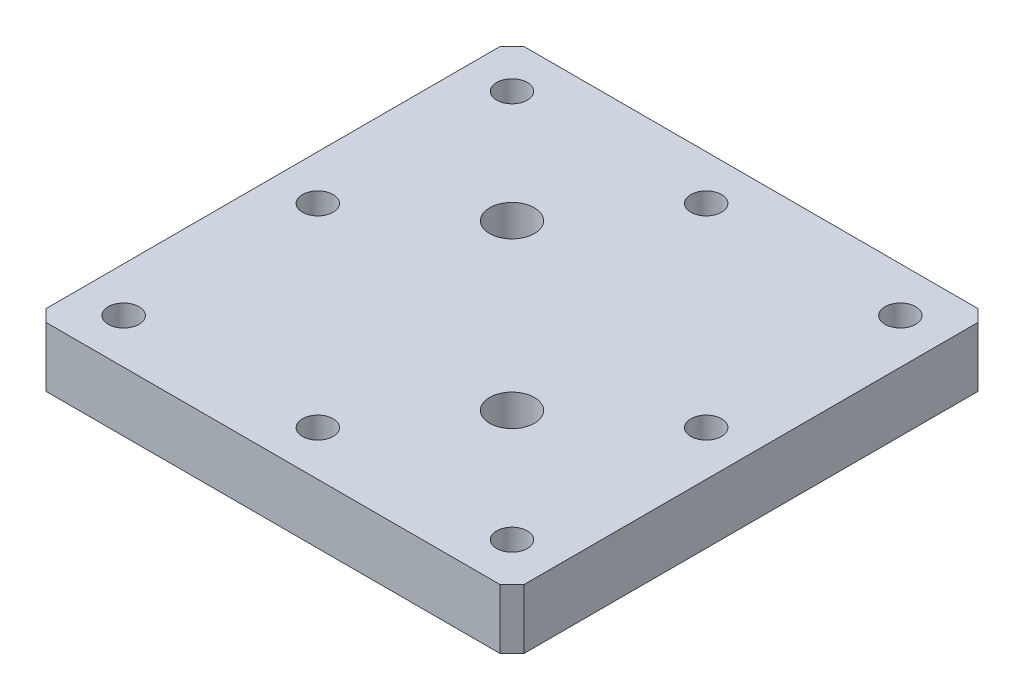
ISO-10303-21;
HEADER;
FILE_DESCRIPTION(('STEP AP214'),'2;1');
FILE_NAME('part.step','',(''),(''),'','','');
FILE_SCHEMA(('AUTOMOTIVE_DESIGN { 1 0 10303 214 1 1 1 1 }'));
ENDSEC;
DATA;
#1=APPLICATION_CONTEXT('core data for automotive mechanical design processes');
#2=APPLICATION_PROTOCOL_DEFINITION('international standard','automotive_design',2000,#1);
#3=PRODUCT_CONTEXT('',#1,'mechanical');
#4=PRODUCT('Part','Part','',(#3));
#5=PRODUCT_RELATED_PRODUCT_CATEGORY('part','',(#4));
#6=PRODUCT_DEFINITION_FORMATION('','',#4);
#7=PRODUCT_DEFINITION_CONTEXT('part definition',#1,'design');
#8=PRODUCT_DEFINITION('design','',#6,#7);
#9=PRODUCT_DEFINITION_SHAPE('','',#8);
#10=(LENGTH_UNIT() NAMED_UNIT(*) SI_UNIT(.MILLI.,.METRE.));
#11=(NAMED_UNIT(*) PLANE_ANGLE_UNIT() SI_UNIT($,.RADIAN.));
#12=(NAMED_UNIT(*) SI_UNIT($,.STERADIAN.) SOLID_ANGLE_UNIT());
#13=UNCERTAINTY_MEASURE_WITH_UNIT(LENGTH_MEASURE(1.E-05),#10,'distance_accuracy_value','');
#14=(GEOMETRIC_REPRESENTATION_CONTEXT(3) GLOBAL_UNCERTAINTY_ASSIGNED_CONTEXT((#13)) GLOBAL_UNIT_ASSIGNED_CONTEXT((#10,
#11,#12)) REPRESENTATION_CONTEXT('',''));
#15=CARTESIAN_POINT('',(0.,0.,0.));
#16=DIRECTION('',(0.,0.,1.));
#17=DIRECTION('',(1.,0.,0.));
#18=AXIS2_PLACEMENT_3D('',#15,#16,#17);
#19=CARTESIAN_POINT('',(-49.53,12.7,49.53));
#20=DIRECTION('',(0.707106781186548,0.,-0.707106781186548));
#21=DIRECTION('',(-0.707106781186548,0.,-0.707106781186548));
#22=AXIS2_PLACEMENT_3D('',#19,#20,#21);
#23=PLANE('',#22);
#24=DIRECTION('',(0.707106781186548,0.,0.707106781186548));
#25=VECTOR('',#24,1.);
#26=CARTESIAN_POINT('',(-49.53,0.,49.53));
#27=LINE('',#26,#25);
#28=CARTESIAN_POINT('',(-50.8,0.,48.26));
#29=VERTEX_POINT('',#28);
#30=CARTESIAN_POINT('',(-48.26,0.,50.8));
#31=VERTEX_POINT('',#30);
#32=EDGE_CURVE('E196',#29,#31,#27,.T.);
#33=ORIENTED_EDGE('',*,*,#32,.T.);
#34=DIRECTION('',(0.,-1.,0.));
#35=VECTOR('',#34,1.);
#36=CARTESIAN_POINT('',(-48.26,12.7,50.8));
#37=LINE('',#36,#35);
#38=CARTESIAN_POINT('',(-48.26,12.7,50.8));
#39=VERTEX_POINT('',#38);
#40=EDGE_CURVE('E84',#39,#31,#37,.T.);
#41=ORIENTED_EDGE('',*,*,#40,.F.);
#42=DIRECTION('',(0.707106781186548,0.,0.707106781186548));
#43=VECTOR('',#42,1.);
#44=CARTESIAN_POINT('',(-49.53,12.7,49.53));
#45=LINE('',#44,#43);
#46=CARTESIAN_POINT('',(-50.8,12.7,48.26));
#47=VERTEX_POINT('',#46);
#48=EDGE_CURVE('E319',#47,#39,#45,.T.);
#49=ORIENTED_EDGE('',*,*,#48,.F.);
#50=DIRECTION('',(0.,-1.,0.));
#51=VECTOR('',#50,1.);
#52=CARTESIAN_POINT('',(-50.8,12.7,48.26));
#53=LINE('',#52,#51);
#54=EDGE_CURVE('E12',#47,#29,#53,.T.);
#55=ORIENTED_EDGE('',*,*,#54,.T.);
#56=EDGE_LOOP('',(#33,#41,#49,#55));
#57=FACE_BOUND('',#56,.T.);
#58=ADVANCED_FACE('F75',(#57),#23,.F.);
#59=CARTESIAN_POINT('',(0.,12.7,50.8));
#60=DIRECTION('',(0.,0.,-1.));
#61=DIRECTION('',(-1.,0.,0.));
#62=AXIS2_PLACEMENT_3D('',#59,#60,#61);
#63=PLANE('',#62);
#64=DIRECTION('',(1.,0.,0.));
#65=VECTOR('',#64,1.);
#66=CARTESIAN_POINT('',(0.,0.,50.8));
#67=LINE('',#66,#65);
#68=CARTESIAN_POINT('',(48.26,0.,50.8));
#69=VERTEX_POINT('',#68);
#70=EDGE_CURVE('E199',#31,#69,#67,.T.);
#71=ORIENTED_EDGE('',*,*,#70,.T.);
#72=DIRECTION('',(0.,-1.,0.));
#73=VECTOR('',#72,1.);
#74=CARTESIAN_POINT('',(48.26,12.7,50.8));
#75=LINE('',#74,#73);
#76=CARTESIAN_POINT('',(48.26,12.7,50.8));
#77=VERTEX_POINT('',#76);
#78=EDGE_CURVE('E221',#77,#69,#75,.T.);
#79=ORIENTED_EDGE('',*,*,#78,.F.);
#80=DIRECTION('',(1.,0.,0.));
#81=VECTOR('',#80,1.);
#82=CARTESIAN_POINT('',(0.,12.7,50.8));
#83=LINE('',#82,#81);
#84=EDGE_CURVE('E229',#39,#77,#83,.T.);
#85=ORIENTED_EDGE('',*,*,#84,.F.);
#86=ORIENTED_EDGE('',*,*,#40,.T.);
#87=EDGE_LOOP('',(#71,#79,#85,#86));
#88=FACE_BOUND('',#87,.T.);
#89=ADVANCED_FACE('F226',(#88),#63,.F.);
#90=CARTESIAN_POINT('',(49.53,12.7,49.53));
#91=DIRECTION('',(-0.707106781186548,0.,-0.707106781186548));
#92=DIRECTION('',(-0.707106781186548,0.,0.707106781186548));
#93=AXIS2_PLACEMENT_3D('',#90,#91,#92);
#94=PLANE('',#93);
#95=DIRECTION('',(0.707106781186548,0.,-0.707106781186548));
#96=VECTOR('',#95,1.);
#97=CARTESIAN_POINT('',(49.53,0.,49.53));
#98=LINE('',#97,#96);
#99=CARTESIAN_POINT('',(50.8,0.,48.26));
#100=VERTEX_POINT('',#99);
#101=EDGE_CURVE('E202',#69,#100,#98,.T.);
#102=ORIENTED_EDGE('',*,*,#101,.T.);
#103=DIRECTION('',(0.,-1.,0.));
#104=VECTOR('',#103,1.);
#105=CARTESIAN_POINT('',(50.8,12.7,48.26));
#106=LINE('',#105,#104);
#107=CARTESIAN_POINT('',(50.8,12.7,48.26));
#108=VERTEX_POINT('',#107);
#109=EDGE_CURVE('E218',#108,#100,#106,.T.);
#110=ORIENTED_EDGE('',*,*,#109,.F.);
#111=DIRECTION('',(0.707106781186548,0.,-0.707106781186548));
#112=VECTOR('',#111,1.);
#113=CARTESIAN_POINT('',(49.53,12.7,49.53));
#114=LINE('',#113,#112);
#115=EDGE_CURVE('E322',#77,#108,#114,.T.);
#116=ORIENTED_EDGE('',*,*,#115,.F.);
#117=ORIENTED_EDGE('',*,*,#78,.T.);
#118=EDGE_LOOP('',(#102,#110,#116,#117));
#119=FACE_BOUND('',#118,.T.);
#120=ADVANCED_FACE('F253',(#119),#94,.F.);
#121=CARTESIAN_POINT('',(50.8,12.7,0.));
#122=DIRECTION('',(-1.,0.,0.));
#123=DIRECTION('',(0.,0.,1.));
#124=AXIS2_PLACEMENT_3D('',#121,#122,#123);
#125=PLANE('',#124);
#126=DIRECTION('',(0.,0.,-1.));
#127=VECTOR('',#126,1.);
#128=CARTESIAN_POINT('',(50.8,0.,0.));
#129=LINE('',#128,#127);
#130=CARTESIAN_POINT('',(50.8,0.,-48.26));
#131=VERTEX_POINT('',#130);
#132=EDGE_CURVE('E205',#100,#131,#129,.T.);
#133=ORIENTED_EDGE('',*,*,#132,.T.);
#134=DIRECTION('',(0.,-1.,0.));
#135=VECTOR('',#134,1.);
#136=CARTESIAN_POINT('',(50.8,12.7,-48.26));
#137=LINE('',#136,#135);
#138=CARTESIAN_POINT('',(50.8,12.7,-48.26));
#139=VERTEX_POINT('',#138);
#140=EDGE_CURVE('E151',#139,#131,#137,.T.);
#141=ORIENTED_EDGE('',*,*,#140,.F.);
#142=DIRECTION('',(0.,0.,-1.));
#143=VECTOR('',#142,1.);
#144=CARTESIAN_POINT('',(50.8,12.7,0.));
#145=LINE('',#144,#143);
#146=EDGE_CURVE('E160',#108,#139,#145,.T.);
#147=ORIENTED_EDGE('',*,*,#146,.F.);
#148=ORIENTED_EDGE('',*,*,#109,.T.);
#149=EDGE_LOOP('',(#133,#141,#147,#148));
#150=FACE_BOUND('',#149,.T.);
#151=ADVANCED_FACE('F258',(#150),#125,.F.);
#152=CARTESIAN_POINT('',(49.53,12.7,-49.53));
#153=DIRECTION('',(0.707106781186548,0.,-0.707106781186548));
#154=DIRECTION('',(-0.707106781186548,0.,-0.707106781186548));
#155=AXIS2_PLACEMENT_3D('',#152,#153,#154);
#156=PLANE('',#155);
#157=DIRECTION('',(0.707106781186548,0.,0.707106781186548));
#158=VECTOR('',#157,1.);
#159=CARTESIAN_POINT('',(49.53,0.,-49.53));
#160=LINE('',#159,#158);
#161=CARTESIAN_POINT('',(48.26,0.,-50.8));
#162=VERTEX_POINT('',#161);
#163=EDGE_CURVE('E147',#162,#131,#160,.T.);
#164=ORIENTED_EDGE('',*,*,#163,.F.);
#165=DIRECTION('',(0.,-1.,0.));
#166=VECTOR('',#165,1.);
#167=CARTESIAN_POINT('',(48.26,12.7,-50.8));
#168=LINE('',#167,#166);
#169=CARTESIAN_POINT('',(48.26,12.7,-50.8));
#170=VERTEX_POINT('',#169);
#171=EDGE_CURVE('E142',#170,#162,#168,.T.);
#172=ORIENTED_EDGE('',*,*,#171,.F.);
#173=DIRECTION('',(0.707106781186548,0.,0.707106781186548));
#174=VECTOR('',#173,1.);
#175=CARTESIAN_POINT('',(49.53,12.7,-49.53));
#176=LINE('',#175,#174);
#177=EDGE_CURVE('E145',#170,#139,#176,.T.);
#178=ORIENTED_EDGE('',*,*,#177,.T.);
#179=ORIENTED_EDGE('',*,*,#140,.T.);
#180=EDGE_LOOP('',(#164,#172,#178,#179));
#181=FACE_BOUND('',#180,.T.);
#182=ADVANCED_FACE('F144',(#181),#156,.T.);
#183=CARTESIAN_POINT('',(0.,12.7,-50.8));
#184=DIRECTION('',(0.,0.,-1.));
#185=DIRECTION('',(-1.,0.,0.));
#186=AXIS2_PLACEMENT_3D('',#183,#184,#185);
#187=PLANE('',#186);
#188=DIRECTION('',(1.,0.,0.));
#189=VECTOR('',#188,1.);
#190=CARTESIAN_POINT('',(0.,0.,-50.8));
#191=LINE('',#190,#189);
#192=CARTESIAN_POINT('',(-48.26,0.,-50.8));
#193=VERTEX_POINT('',#192);
#194=EDGE_CURVE('E209',#193,#162,#191,.T.);
#195=ORIENTED_EDGE('',*,*,#194,.F.);
#196=DIRECTION('',(0.,-1.,0.));
#197=VECTOR('',#196,1.);
#198=CARTESIAN_POINT('',(-48.26,12.7,-50.8));
#199=LINE('',#198,#197);
#200=CARTESIAN_POINT('',(-48.26,12.7,-50.8));
#201=VERTEX_POINT('',#200);
#202=EDGE_CURVE('E117',#201,#193,#199,.T.);
#203=ORIENTED_EDGE('',*,*,#202,.F.);
#204=DIRECTION('',(1.,0.,0.));
#205=VECTOR('',#204,1.);
#206=CARTESIAN_POINT('',(0.,12.7,-50.8));
#207=LINE('',#206,#205);
#208=EDGE_CURVE('E158',#201,#170,#207,.T.);
#209=ORIENTED_EDGE('',*,*,#208,.T.);
#210=ORIENTED_EDGE('',*,*,#171,.T.);
#211=EDGE_LOOP('',(#195,#203,#209,#210));
#212=FACE_BOUND('',#211,.T.);
#213=ADVANCED_FACE('F163',(#212),#187,.T.);
#214=CARTESIAN_POINT('',(-49.53,12.7,-49.53));
#215=DIRECTION('',(-0.707106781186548,0.,-0.707106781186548));
#216=DIRECTION('',(-0.707106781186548,0.,0.707106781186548));
#217=AXIS2_PLACEMENT_3D('',#214,#215,#216);
#218=PLANE('',#217);
#219=DIRECTION('',(0.707106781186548,0.,-0.707106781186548));
#220=VECTOR('',#219,1.);
#221=CARTESIAN_POINT('',(-49.53,0.,-49.53));
#222=LINE('',#221,#220);
#223=CARTESIAN_POINT('',(-50.8,0.,-48.26));
#224=VERTEX_POINT('',#223);
#225=EDGE_CURVE('E211',#224,#193,#222,.T.);
#226=ORIENTED_EDGE('',*,*,#225,.F.);
#227=DIRECTION('',(0.,-1.,0.));
#228=VECTOR('',#227,1.);
#229=CARTESIAN_POINT('',(-50.8,12.7,-48.26));
#230=LINE('',#229,#228);
#231=CARTESIAN_POINT('',(-50.8,12.7,-48.26));
#232=VERTEX_POINT('',#231);
#233=EDGE_CURVE('E92',#232,#224,#230,.T.);
#234=ORIENTED_EDGE('',*,*,#233,.F.);
#235=DIRECTION('',(0.707106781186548,0.,-0.707106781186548));
#236=VECTOR('',#235,1.);
#237=CARTESIAN_POINT('',(-49.53,12.7,-49.53));
#238=LINE('',#237,#236);
#239=EDGE_CURVE('E164',#232,#201,#238,.T.);
#240=ORIENTED_EDGE('',*,*,#239,.T.);
#241=ORIENTED_EDGE('',*,*,#202,.T.);
#242=EDGE_LOOP('',(#226,#234,#240,#241));
#243=FACE_BOUND('',#242,.T.);
#244=ADVANCED_FACE('F238',(#243),#218,.T.);
#245=CARTESIAN_POINT('',(-50.8,12.7,0.));
#246=DIRECTION('',(-1.,0.,0.));
#247=DIRECTION('',(0.,0.,1.));
#248=AXIS2_PLACEMENT_3D('',#245,#246,#247);
#249=PLANE('',#248);
#250=DIRECTION('',(0.,0.,-1.));
#251=VECTOR('',#250,1.);
#252=CARTESIAN_POINT('',(-50.8,0.,0.));
#253=LINE('',#252,#251);
#254=EDGE_CURVE('E194',#29,#224,#253,.T.);
#255=ORIENTED_EDGE('',*,*,#254,.F.);
#256=ORIENTED_EDGE('',*,*,#54,.F.);
#257=DIRECTION('',(0.,0.,-1.));
#258=VECTOR('',#257,1.);
#259=CARTESIAN_POINT('',(-50.8,12.7,0.));
#260=LINE('',#259,#258);
#261=EDGE_CURVE('E317',#47,#232,#260,.T.);
#262=ORIENTED_EDGE('',*,*,#261,.T.);
#263=ORIENTED_EDGE('',*,*,#233,.T.);
#264=EDGE_LOOP('',(#255,#256,#262,#263));
#265=FACE_BOUND('',#264,.T.);
#266=ADVANCED_FACE('F235',(#265),#249,.T.);
#267=CARTESIAN_POINT('',(-41.275,12.7,-41.275));
#268=DIRECTION('',(0.,-1.,0.));
#269=DIRECTION('',(0.,0.,-1.));
#270=AXIS2_PLACEMENT_3D('',#267,#268,#269);
#271=CYLINDRICAL_SURFACE('',#270,3.2639);
#272=CARTESIAN_POINT('',(-41.275,12.7,-41.275));
#273=DIRECTION('',(0.,1.,0.));
#274=DIRECTION('',(0.,0.,1.));
#275=AXIS2_PLACEMENT_3D('',#272,#273,#274);
#276=CIRCLE('',#275,3.2639);
#277=CARTESIAN_POINT('',(-41.275,12.7,-38.0111));
#278=VERTEX_POINT('',#277);
#279=EDGE_CURVE('E314',#278,#278,#276,.T.);
#280=ORIENTED_EDGE('',*,*,#279,.T.);
#281=EDGE_LOOP('',(#280));
#282=FACE_BOUND('',#281,.T.);
#283=CARTESIAN_POINT('',(-41.275,0.,-41.275));
#284=DIRECTION('',(0.,1.,0.));
#285=DIRECTION('',(0.,0.,1.));
#286=AXIS2_PLACEMENT_3D('',#283,#284,#285);
#287=CIRCLE('',#286,3.2639);
#288=CARTESIAN_POINT('',(-41.275,0.,-38.0111));
#289=VERTEX_POINT('',#288);
#290=EDGE_CURVE('E191',#289,#289,#287,.T.);
#291=ORIENTED_EDGE('',*,*,#290,.F.);
#292=EDGE_LOOP('',(#291));
#293=FACE_BOUND('',#292,.T.);
#294=ADVANCED_FACE('F237',(#282,#293),#271,.F.);
#295=CARTESIAN_POINT('',(41.275,12.7,-41.275));
#296=DIRECTION('',(0.,-1.,0.));
#297=DIRECTION('',(0.,0.,-1.));
#298=AXIS2_PLACEMENT_3D('',#295,#296,#297);
#299=CYLINDRICAL_SURFACE('',#298,3.2639);
#300=CARTESIAN_POINT('',(41.275,12.7,-41.275));
#301=DIRECTION('',(0.,1.,0.));
#302=DIRECTION('',(0.,0.,1.));
#303=AXIS2_PLACEMENT_3D('',#300,#301,#302);
#304=CIRCLE('',#303,3.2639);
#305=CARTESIAN_POINT('',(41.275,12.7,-38.0111));
#306=VERTEX_POINT('',#305);
#307=EDGE_CURVE('E311',#306,#306,#304,.T.);
#308=ORIENTED_EDGE('',*,*,#307,.T.);
#309=EDGE_LOOP('',(#308));
#310=FACE_BOUND('',#309,.T.);
#311=CARTESIAN_POINT('',(41.275,0.,-41.275));
#312=DIRECTION('',(0.,1.,0.));
#313=DIRECTION('',(0.,0.,1.));
#314=AXIS2_PLACEMENT_3D('',#311,#312,#313);
#315=CIRCLE('',#314,3.2639);
#316=CARTESIAN_POINT('',(41.275,0.,-38.0111));
#317=VERTEX_POINT('',#316);
#318=EDGE_CURVE('E188',#317,#317,#315,.T.);
#319=ORIENTED_EDGE('',*,*,#318,.F.);
#320=EDGE_LOOP('',(#319));
#321=FACE_BOUND('',#320,.T.);
#322=ADVANCED_FACE('F244',(#310,#321),#299,.F.);
#323=CARTESIAN_POINT('',(41.275,12.7,0.));
#324=DIRECTION('',(0.,-1.,0.));
#325=DIRECTION('',(0.,0.,-1.));
#326=AXIS2_PLACEMENT_3D('',#323,#324,#325);
#327=CYLINDRICAL_SURFACE('',#326,3.2639);
#328=CARTESIAN_POINT('',(41.275,12.7,0.));
#329=DIRECTION('',(0.,1.,0.));
#330=DIRECTION('',(0.,0.,1.));
#331=AXIS2_PLACEMENT_3D('',#328,#329,#330);
#332=CIRCLE('',#331,3.2639);
#333=CARTESIAN_POINT('',(41.275,12.7,3.26389999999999));
#334=VERTEX_POINT('',#333);
#335=EDGE_CURVE('E308',#334,#334,#332,.T.);
#336=ORIENTED_EDGE('',*,*,#335,.T.);
#337=EDGE_LOOP('',(#336));
#338=FACE_BOUND('',#337,.T.);
#339=CARTESIAN_POINT('',(41.275,0.,0.));
#340=DIRECTION('',(0.,1.,0.));
#341=DIRECTION('',(0.,0.,1.));
#342=AXIS2_PLACEMENT_3D('',#339,#340,#341);
#343=CIRCLE('',#342,3.2639);
#344=CARTESIAN_POINT('',(41.275,0.,3.26389999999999));
#345=VERTEX_POINT('',#344);
#346=EDGE_CURVE('E185',#345,#345,#343,.T.);
#347=ORIENTED_EDGE('',*,*,#346,.F.);
#348=EDGE_LOOP('',(#347));
#349=FACE_BOUND('',#348,.T.);
#350=ADVANCED_FACE('F334',(#338,#349),#327,.F.);
#351=CARTESIAN_POINT('',(41.275,12.7,41.275));
#352=DIRECTION('',(0.,-1.,0.));
#353=DIRECTION('',(0.,0.,-1.));
#354=AXIS2_PLACEMENT_3D('',#351,#352,#353);
#355=CYLINDRICAL_SURFACE('',#354,3.2639);
#356=CARTESIAN_POINT('',(41.275,12.7,41.275));
#357=DIRECTION('',(0.,1.,0.));
#358=DIRECTION('',(0.,0.,1.));
#359=AXIS2_PLACEMENT_3D('',#356,#357,#358);
#360=CIRCLE('',#359,3.2639);
#361=CARTESIAN_POINT('',(41.275,12.7,44.5389));
#362=VERTEX_POINT('',#361);
#363=EDGE_CURVE('E305',#362,#362,#360,.T.);
#364=ORIENTED_EDGE('',*,*,#363,.T.);
#365=EDGE_LOOP('',(#364));
#366=FACE_BOUND('',#365,.T.);
#367=CARTESIAN_POINT('',(41.275,0.,41.275));
#368=DIRECTION('',(0.,1.,0.));
#369=DIRECTION('',(0.,0.,1.));
#370=AXIS2_PLACEMENT_3D('',#367,#368,#369);
#371=CIRCLE('',#370,3.2639);
#372=CARTESIAN_POINT('',(41.275,0.,44.5389));
#373=VERTEX_POINT('',#372);
#374=EDGE_CURVE('E182',#373,#373,#371,.T.);
#375=ORIENTED_EDGE('',*,*,#374,.F.);
#376=EDGE_LOOP('',(#375));
#377=FACE_BOUND('',#376,.T.);
#378=ADVANCED_FACE('F341',(#366,#377),#355,.F.);
#379=CARTESIAN_POINT('',(-41.275,12.7,41.275));
#380=DIRECTION('',(0.,-1.,0.));
#381=DIRECTION('',(0.,0.,-1.));
#382=AXIS2_PLACEMENT_3D('',#379,#380,#381);
#383=CYLINDRICAL_SURFACE('',#382,3.2639);
#384=CARTESIAN_POINT('',(-41.275,12.7,41.275));
#385=DIRECTION('',(0.,1.,0.));
#386=DIRECTION('',(0.,0.,1.));
#387=AXIS2_PLACEMENT_3D('',#384,#385,#386);
#388=CIRCLE('',#387,3.2639);
#389=CARTESIAN_POINT('',(-41.275,12.7,44.5389));
#390=VERTEX_POINT('',#389);
#391=EDGE_CURVE('E302',#390,#390,#388,.T.);
#392=ORIENTED_EDGE('',*,*,#391,.T.);
#393=EDGE_LOOP('',(#392));
#394=FACE_BOUND('',#393,.T.);
#395=CARTESIAN_POINT('',(-41.275,0.,41.275));
#396=DIRECTION('',(0.,1.,0.));
#397=DIRECTION('',(0.,0.,1.));
#398=AXIS2_PLACEMENT_3D('',#395,#396,#397);
#399=CIRCLE('',#398,3.2639);
#400=CARTESIAN_POINT('',(-41.275,0.,44.5389));
#401=VERTEX_POINT('',#400);
#402=EDGE_CURVE('E179',#401,#401,#399,.T.);
#403=ORIENTED_EDGE('',*,*,#402,.F.);
#404=EDGE_LOOP('',(#403));
#405=FACE_BOUND('',#404,.T.);
#406=ADVANCED_FACE('F347',(#394,#405),#383,.F.);
#407=CARTESIAN_POINT('',(-41.275,12.7,0.));
#408=DIRECTION('',(0.,-1.,0.));
#409=DIRECTION('',(0.,0.,-1.));
#410=AXIS2_PLACEMENT_3D('',#407,#408,#409);
#411=CYLINDRICAL_SURFACE('',#410,3.2639);
#412=CARTESIAN_POINT('',(-41.275,12.7,0.));
#413=DIRECTION('',(0.,1.,0.));
#414=DIRECTION('',(0.,0.,1.));
#415=AXIS2_PLACEMENT_3D('',#412,#413,#414);
#416=CIRCLE('',#415,3.2639);
#417=CARTESIAN_POINT('',(-41.275,12.7,3.26390000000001));
#418=VERTEX_POINT('',#417);
#419=EDGE_CURVE('E299',#418,#418,#416,.T.);
#420=ORIENTED_EDGE('',*,*,#419,.T.);
#421=EDGE_LOOP('',(#420));
#422=FACE_BOUND('',#421,.T.);
#423=CARTESIAN_POINT('',(-41.275,0.,0.));
#424=DIRECTION('',(0.,1.,0.));
#425=DIRECTION('',(0.,0.,1.));
#426=AXIS2_PLACEMENT_3D('',#423,#424,#425);
#427=CIRCLE('',#426,3.2639);
#428=CARTESIAN_POINT('',(-41.275,0.,3.26390000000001));
#429=VERTEX_POINT('',#428);
#430=EDGE_CURVE('E176',#429,#429,#427,.T.);
#431=ORIENTED_EDGE('',*,*,#430,.F.);
#432=EDGE_LOOP('',(#431));
#433=FACE_BOUND('',#432,.T.);
#434=ADVANCED_FACE('F351',(#422,#433),#411,.F.);
#435=CARTESIAN_POINT('',(0.,12.7,-41.275));
#436=DIRECTION('',(0.,-1.,0.));
#437=DIRECTION('',(0.,0.,-1.));
#438=AXIS2_PLACEMENT_3D('',#435,#436,#437);
#439=CYLINDRICAL_SURFACE('',#438,3.2639);
#440=CARTESIAN_POINT('',(0.,12.7,-41.275));
#441=DIRECTION('',(0.,1.,0.));
#442=DIRECTION('',(0.,0.,1.));
#443=AXIS2_PLACEMENT_3D('',#440,#441,#442);
#444=CIRCLE('',#443,3.2639);
#445=CARTESIAN_POINT('',(0.,12.7,-38.0111));
#446=VERTEX_POINT('',#445);
#447=EDGE_CURVE('E296',#446,#446,#444,.T.);
#448=ORIENTED_EDGE('',*,*,#447,.T.);
#449=EDGE_LOOP('',(#448));
#450=FACE_BOUND('',#449,.T.);
#451=CARTESIAN_POINT('',(0.,0.,-41.275));
#452=DIRECTION('',(0.,1.,0.));
#453=DIRECTION('',(0.,0.,1.));
#454=AXIS2_PLACEMENT_3D('',#451,#452,#453);
#455=CIRCLE('',#454,3.2639);
#456=CARTESIAN_POINT('',(0.,0.,-38.0111));
#457=VERTEX_POINT('',#456);
#458=EDGE_CURVE('E172',#457,#457,#455,.T.);
#459=ORIENTED_EDGE('',*,*,#458,.F.);
#460=EDGE_LOOP('',(#459));
#461=FACE_BOUND('',#460,.T.);
#462=ADVANCED_FACE('F354',(#450,#461),#439,.F.);
#463=CARTESIAN_POINT('',(0.,12.7,41.275));
#464=DIRECTION('',(0.,-1.,0.));
#465=DIRECTION('',(0.,0.,-1.));
#466=AXIS2_PLACEMENT_3D('',#463,#464,#465);
#467=CYLINDRICAL_SURFACE('',#466,3.2639);
#468=CARTESIAN_POINT('',(0.,12.7,41.275));
#469=DIRECTION('',(0.,1.,0.));
#470=DIRECTION('',(0.,0.,1.));
#471=AXIS2_PLACEMENT_3D('',#468,#469,#470);
#472=CIRCLE('',#471,3.2639);
#473=CARTESIAN_POINT('',(0.,12.7,44.5389));
#474=VERTEX_POINT('',#473);
#475=EDGE_CURVE('E214',#474,#474,#472,.T.);
#476=ORIENTED_EDGE('',*,*,#475,.T.);
#477=EDGE_LOOP('',(#476));
#478=FACE_BOUND('',#477,.T.);
#479=CARTESIAN_POINT('',(0.,0.,41.275));
#480=DIRECTION('',(0.,1.,0.));
#481=DIRECTION('',(0.,0.,1.));
#482=AXIS2_PLACEMENT_3D('',#479,#480,#481);
#483=CIRCLE('',#482,3.2639);
#484=CARTESIAN_POINT('',(0.,0.,44.5389));
#485=VERTEX_POINT('',#484);
#486=EDGE_CURVE('E169',#485,#485,#483,.T.);
#487=ORIENTED_EDGE('',*,*,#486,.F.);
#488=EDGE_LOOP('',(#487));
#489=FACE_BOUND('',#488,.T.);
#490=ADVANCED_FACE('F77',(#478,#489),#467,.F.);
#491=CARTESIAN_POINT('',(0.,0.,0.));
#492=DIRECTION('',(0.,1.,0.));
#493=DIRECTION('',(0.,0.,1.));
#494=AXIS2_PLACEMENT_3D('',#491,#492,#493);
#495=PLANE('',#494);
#496=CARTESIAN_POINT('',(-17.4625,0.,-17.4625));
#497=DIRECTION('',(0.,1.,0.));
#498=DIRECTION('',(0.,0.,1.));
#499=AXIS2_PLACEMENT_3D('',#496,#497,#498);
#500=CIRCLE('',#499,4.7625);
#501=CARTESIAN_POINT('',(-17.4625,0.,-12.7));
#502=VERTEX_POINT('',#501);
#503=EDGE_CURVE('E173',#502,#502,#500,.T.);
#504=ORIENTED_EDGE('',*,*,#503,.T.);
#505=EDGE_LOOP('',(#504));
#506=FACE_BOUND('',#505,.T.);
#507=CARTESIAN_POINT('',(17.4625,0.,17.4625));
#508=DIRECTION('',(0.,1.,0.));
#509=DIRECTION('',(0.,0.,1.));
#510=AXIS2_PLACEMENT_3D('',#507,#508,#509);
#511=CIRCLE('',#510,4.7625);
#512=CARTESIAN_POINT('',(17.4625,0.,22.225));
#513=VERTEX_POINT('',#512);
#514=EDGE_CURVE('E288',#513,#513,#511,.T.);
#515=ORIENTED_EDGE('',*,*,#514,.T.);
#516=EDGE_LOOP('',(#515));
#517=FACE_BOUND('',#516,.T.);
#518=ORIENTED_EDGE('',*,*,#486,.T.);
#519=EDGE_LOOP('',(#518));
#520=FACE_BOUND('',#519,.T.);
#521=ORIENTED_EDGE('',*,*,#458,.T.);
#522=EDGE_LOOP('',(#521));
#523=FACE_BOUND('',#522,.T.);
#524=ORIENTED_EDGE('',*,*,#430,.T.);
#525=EDGE_LOOP('',(#524));
#526=FACE_BOUND('',#525,.T.);
#527=ORIENTED_EDGE('',*,*,#402,.T.);
#528=EDGE_LOOP('',(#527));
#529=FACE_BOUND('',#528,.T.);
#530=ORIENTED_EDGE('',*,*,#374,.T.);
#531=EDGE_LOOP('',(#530));
#532=FACE_BOUND('',#531,.T.);
#533=ORIENTED_EDGE('',*,*,#346,.T.);
#534=EDGE_LOOP('',(#533));
#535=FACE_BOUND('',#534,.T.);
#536=ORIENTED_EDGE('',*,*,#318,.T.);
#537=EDGE_LOOP('',(#536));
#538=FACE_BOUND('',#537,.T.);
#539=ORIENTED_EDGE('',*,*,#290,.T.);
#540=EDGE_LOOP('',(#539));
#541=FACE_BOUND('',#540,.T.);
#542=ORIENTED_EDGE('',*,*,#254,.T.);
#543=ORIENTED_EDGE('',*,*,#225,.T.);
#544=ORIENTED_EDGE('',*,*,#194,.T.);
#545=ORIENTED_EDGE('',*,*,#163,.T.);
#546=ORIENTED_EDGE('',*,*,#132,.F.);
#547=ORIENTED_EDGE('',*,*,#101,.F.);
#548=ORIENTED_EDGE('',*,*,#70,.F.);
#549=ORIENTED_EDGE('',*,*,#32,.F.);
#550=EDGE_LOOP('',(#542,#543,#544,#545,#546,#547,#548,#549));
#551=FACE_BOUND('',#550,.T.);
#552=ADVANCED_FACE('F234',(#506,#517,#520,#523,#526,#529,#532,#535,#538,#541,#551),#495,.F.);
#553=CARTESIAN_POINT('',(0.,12.7,0.));
#554=DIRECTION('',(0.,1.,0.));
#555=DIRECTION('',(0.,0.,1.));
#556=AXIS2_PLACEMENT_3D('',#553,#554,#555);
#557=PLANE('',#556);
#558=CARTESIAN_POINT('',(-17.4625,12.7,-17.4625));
#559=DIRECTION('',(0.,1.,0.));
#560=DIRECTION('',(0.,0.,1.));
#561=AXIS2_PLACEMENT_3D('',#558,#559,#560);
#562=CIRCLE('',#561,4.7625);
#563=CARTESIAN_POINT('',(-17.4625,12.7,-12.7));
#564=VERTEX_POINT('',#563);
#565=EDGE_CURVE('E285',#564,#564,#562,.T.);
#566=ORIENTED_EDGE('',*,*,#565,.F.);
#567=EDGE_LOOP('',(#566));
#568=FACE_BOUND('',#567,.T.);
#569=CARTESIAN_POINT('',(17.4625,12.7,17.4625));
#570=DIRECTION('',(0.,1.,0.));
#571=DIRECTION('',(0.,0.,1.));
#572=AXIS2_PLACEMENT_3D('',#569,#570,#571);
#573=CIRCLE('',#572,4.7625);
#574=CARTESIAN_POINT('',(17.4625,12.7,22.225));
#575=VERTEX_POINT('',#574);
#576=EDGE_CURVE('E542',#575,#575,#573,.T.);
#577=ORIENTED_EDGE('',*,*,#576,.F.);
#578=EDGE_LOOP('',(#577));
#579=FACE_BOUND('',#578,.T.);
#580=ORIENTED_EDGE('',*,*,#475,.F.);
#581=EDGE_LOOP('',(#580));
#582=FACE_BOUND('',#581,.T.);
#583=ORIENTED_EDGE('',*,*,#447,.F.);
#584=EDGE_LOOP('',(#583));
#585=FACE_BOUND('',#584,.T.);
#586=ORIENTED_EDGE('',*,*,#419,.F.);
#587=EDGE_LOOP('',(#586));
#588=FACE_BOUND('',#587,.T.);
#589=ORIENTED_EDGE('',*,*,#391,.F.);
#590=EDGE_LOOP('',(#589));
#591=FACE_BOUND('',#590,.T.);
#592=ORIENTED_EDGE('',*,*,#363,.F.);
#593=EDGE_LOOP('',(#592));
#594=FACE_BOUND('',#593,.T.);
#595=ORIENTED_EDGE('',*,*,#335,.F.);
#596=EDGE_LOOP('',(#595));
#597=FACE_BOUND('',#596,.T.);
#598=ORIENTED_EDGE('',*,*,#307,.F.);
#599=EDGE_LOOP('',(#598));
#600=FACE_BOUND('',#599,.T.);
#601=ORIENTED_EDGE('',*,*,#279,.F.);
#602=EDGE_LOOP('',(#601));
#603=FACE_BOUND('',#602,.T.);
#604=ORIENTED_EDGE('',*,*,#261,.F.);
#605=ORIENTED_EDGE('',*,*,#48,.T.);
#606=ORIENTED_EDGE('',*,*,#84,.T.);
#607=ORIENTED_EDGE('',*,*,#115,.T.);
#608=ORIENTED_EDGE('',*,*,#146,.T.);
#609=ORIENTED_EDGE('',*,*,#177,.F.);
#610=ORIENTED_EDGE('',*,*,#208,.F.);
#611=ORIENTED_EDGE('',*,*,#239,.F.);
#612=EDGE_LOOP('',(#604,#605,#606,#607,#608,#609,#610,#611));
#613=FACE_BOUND('',#612,.T.);
#614=ADVANCED_FACE('F156',(#568,#579,#582,#585,#588,#591,#594,#597,#600,#603,#613),#557,.T.);
#615=CARTESIAN_POINT('',(17.4625,-1.2E-05,17.4625));
#616=DIRECTION('',(0.,1.,0.));
#617=DIRECTION('',(0.,0.,1.));
#618=AXIS2_PLACEMENT_3D('',#615,#616,#617);
#619=CYLINDRICAL_SURFACE('',#618,4.7625);
#620=CARTESIAN_POINT('',(17.4625,12.7,22.225));
#621=CARTESIAN_POINT('',(17.4625,12.5677083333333,22.225));
#622=CARTESIAN_POINT('',(17.4625,12.4354166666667,22.225));
#623=CARTESIAN_POINT('',(17.4625,12.1708333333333,22.225));
#624=CARTESIAN_POINT('',(17.4625,12.0385416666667,22.225));
#625=CARTESIAN_POINT('',(17.4625,11.7739583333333,22.225));
#626=CARTESIAN_POINT('',(17.4625,11.6416666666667,22.225));
#627=CARTESIAN_POINT('',(17.4625,11.3770833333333,22.225));
#628=CARTESIAN_POINT('',(17.4625,11.2447916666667,22.225));
#629=CARTESIAN_POINT('',(17.4625,10.9802083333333,22.225));
#630=CARTESIAN_POINT('',(17.4625,10.8479166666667,22.225));
#631=CARTESIAN_POINT('',(17.4625,10.5833333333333,22.225));
#632=CARTESIAN_POINT('',(17.4625,10.4510416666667,22.225));
#633=CARTESIAN_POINT('',(17.4625,10.1864583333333,22.225));
#634=CARTESIAN_POINT('',(17.4625,10.0541666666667,22.225));
#635=CARTESIAN_POINT('',(17.4625,9.78958333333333,22.225));
#636=CARTESIAN_POINT('',(17.4625,9.65729166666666,22.225));
#637=CARTESIAN_POINT('',(17.4625,9.39270833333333,22.225));
#638=CARTESIAN_POINT('',(17.4625,9.26041666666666,22.225));
#639=CARTESIAN_POINT('',(17.4625,8.99583333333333,22.225));
#640=CARTESIAN_POINT('',(17.4625,8.86354166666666,22.225));
#641=CARTESIAN_POINT('',(17.4625,8.59895833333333,22.225));
#642=CARTESIAN_POINT('',(17.4625,8.46666666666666,22.225));
#643=CARTESIAN_POINT('',(17.4625,8.20208333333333,22.225));
#644=CARTESIAN_POINT('',(17.4625,8.06979166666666,22.225));
#645=CARTESIAN_POINT('',(17.4625,7.80520833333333,22.225));
#646=CARTESIAN_POINT('',(17.4625,7.67291666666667,22.225));
#647=CARTESIAN_POINT('',(17.4625,7.40833333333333,22.225));
#648=CARTESIAN_POINT('',(17.4625,7.27604166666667,22.225));
#649=CARTESIAN_POINT('',(17.4625,7.01145833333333,22.225));
#650=CARTESIAN_POINT('',(17.4625,6.87916666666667,22.225));
#651=CARTESIAN_POINT('',(17.4625,6.61458333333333,22.225));
#652=CARTESIAN_POINT('',(17.4625,6.48229166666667,22.225));
#653=CARTESIAN_POINT('',(17.4625,6.21770833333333,22.225));
#654=CARTESIAN_POINT('',(17.4625,6.08541666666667,22.225));
#655=CARTESIAN_POINT('',(17.4625,5.82083333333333,22.225));
#656=CARTESIAN_POINT('',(17.4625,5.68854166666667,22.225));
#657=CARTESIAN_POINT('',(17.4625,5.42395833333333,22.225));
#658=CARTESIAN_POINT('',(17.4625,5.29166666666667,22.225));
#659=CARTESIAN_POINT('',(17.4625,5.02708333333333,22.225));
#660=CARTESIAN_POINT('',(17.4625,4.89479166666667,22.225));
#661=CARTESIAN_POINT('',(17.4625,4.63020833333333,22.225));
#662=CARTESIAN_POINT('',(17.4625,4.49791666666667,22.225));
#663=CARTESIAN_POINT('',(17.4625,4.23333333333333,22.225));
#664=CARTESIAN_POINT('',(17.4625,4.10104166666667,22.225));
#665=CARTESIAN_POINT('',(17.4625,3.83645833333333,22.225));
#666=CARTESIAN_POINT('',(17.4625,3.70416666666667,22.225));
#667=CARTESIAN_POINT('',(17.4625,3.43958333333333,22.225));
#668=CARTESIAN_POINT('',(17.4625,3.30729166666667,22.225));
#669=CARTESIAN_POINT('',(17.4625,3.04270833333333,22.225));
#670=CARTESIAN_POINT('',(17.4625,2.91041666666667,22.225));
#671=CARTESIAN_POINT('',(17.4625,2.64583333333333,22.225));
#672=CARTESIAN_POINT('',(17.4625,2.51354166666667,22.225));
#673=CARTESIAN_POINT('',(17.4625,2.24895833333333,22.225));
#674=CARTESIAN_POINT('',(17.4625,2.11666666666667,22.225));
#675=CARTESIAN_POINT('',(17.4625,1.85208333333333,22.225));
#676=CARTESIAN_POINT('',(17.4625,1.71979166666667,22.225));
#677=CARTESIAN_POINT('',(17.4625,1.45520833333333,22.225));
#678=CARTESIAN_POINT('',(17.4625,1.32291666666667,22.225));
#679=CARTESIAN_POINT('',(17.4625,1.05833333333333,22.225));
#680=CARTESIAN_POINT('',(17.4625,0.926041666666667,22.225));
#681=CARTESIAN_POINT('',(17.4625,0.661458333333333,22.225));
#682=CARTESIAN_POINT('',(17.4625,0.529166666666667,22.225));
#683=CARTESIAN_POINT('',(17.4625,0.264583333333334,22.225));
#684=CARTESIAN_POINT('',(17.4625,0.132291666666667,22.225));
#685=CARTESIAN_POINT('',(17.4625,0.,22.225));
#686=B_SPLINE_CURVE_WITH_KNOTS('',3,(#620,#621,#622,#623,#624,#625,#626,#627,#628,#629,#630,
#631,#632,#633,#634,#635,#636,#637,#638,#639,#640,#641,#642,#643,#644,#645,#646,#647,#648,#649,
#650,#651,#652,#653,#654,#655,#656,#657,#658,#659,#660,#661,#662,#663,#664,#665,#666,#667,#668,
#669,#670,#671,#672,#673,#674,#675,#676,#677,#678,#679,#680,#681,#682,#683,#684,#685),
.UNSPECIFIED.,.F.,.F.,(4,2,2,2,2,2,2,2,2,2,2,2,2,2,2,2,2,2,2,2,2,2,2,2,2,2,2,2,2,2,2,2,4),(0.,
0.396875,0.793749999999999,1.190625,1.5875,1.984375,2.38125,2.778125,3.175,3.571875,3.96875,
4.365625,4.7625,5.159375,5.55625,5.953125,6.35,6.746875,7.14375,7.540625,7.9375,8.334375,
8.73125,9.128125,9.525,9.921875,10.31875,10.715625,11.1125,11.509375,11.90625,12.303125,12.7),.UNSPECIFIED.);
#687=EDGE_CURVE('BSEAM272',#575,#513,#686,.T.);
#688=ORIENTED_EDGE('',*,*,#576,.T.);
#689=ORIENTED_EDGE('',*,*,#514,.F.);
#690=ORIENTED_EDGE('',*,*,#687,.T.);
#691=ORIENTED_EDGE('',*,*,#687,.F.);
#692=EDGE_LOOP('',(#688,#690,#689,#691));
#693=FACE_BOUND('',#692,.T.);
#694=ADVANCED_FACE('F272',(#693),#619,.F.);
#695=CARTESIAN_POINT('',(-17.4625,-1.2E-05,-17.4625));
#696=DIRECTION('',(0.,1.,0.));
#697=DIRECTION('',(0.,0.,1.));
#698=AXIS2_PLACEMENT_3D('',#695,#696,#697);
#699=CYLINDRICAL_SURFACE('',#698,4.7625);
#700=CARTESIAN_POINT('',(-17.4625,12.7,-12.7));
#701=CARTESIAN_POINT('',(-17.4625,12.5677083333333,-12.7));
#702=CARTESIAN_POINT('',(-17.4625,12.4354166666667,-12.7));
#703=CARTESIAN_POINT('',(-17.4625,12.1708333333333,-12.7));
#704=CARTESIAN_POINT('',(-17.4625,12.0385416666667,-12.7));
#705=CARTESIAN_POINT('',(-17.4625,11.7739583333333,-12.7));
#706=CARTESIAN_POINT('',(-17.4625,11.6416666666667,-12.7));
#707=CARTESIAN_POINT('',(-17.4625,11.3770833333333,-12.7));
#708=CARTESIAN_POINT('',(-17.4625,11.2447916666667,-12.7));
#709=CARTESIAN_POINT('',(-17.4625,10.9802083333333,-12.7));
#710=CARTESIAN_POINT('',(-17.4625,10.8479166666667,-12.7));
#711=CARTESIAN_POINT('',(-17.4625,10.5833333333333,-12.7));
#712=CARTESIAN_POINT('',(-17.4625,10.4510416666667,-12.7));
#713=CARTESIAN_POINT('',(-17.4625,10.1864583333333,-12.7));
#714=CARTESIAN_POINT('',(-17.4625,10.0541666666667,-12.7));
#715=CARTESIAN_POINT('',(-17.4625,9.78958333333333,-12.7));
#716=CARTESIAN_POINT('',(-17.4625,9.65729166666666,-12.7));
#717=CARTESIAN_POINT('',(-17.4625,9.39270833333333,-12.7));
#718=CARTESIAN_POINT('',(-17.4625,9.26041666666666,-12.7));
#719=CARTESIAN_POINT('',(-17.4625,8.99583333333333,-12.7));
#720=CARTESIAN_POINT('',(-17.4625,8.86354166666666,-12.7));
#721=CARTESIAN_POINT('',(-17.4625,8.59895833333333,-12.7));
#722=CARTESIAN_POINT('',(-17.4625,8.46666666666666,-12.7));
#723=CARTESIAN_POINT('',(-17.4625,8.20208333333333,-12.7));
#724=CARTESIAN_POINT('',(-17.4625,8.06979166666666,-12.7));
#725=CARTESIAN_POINT('',(-17.4625,7.80520833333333,-12.7));
#726=CARTESIAN_POINT('',(-17.4625,7.67291666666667,-12.7));
#727=CARTESIAN_POINT('',(-17.4625,7.40833333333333,-12.7));
#728=CARTESIAN_POINT('',(-17.4625,7.27604166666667,-12.7));
#729=CARTESIAN_POINT('',(-17.4625,7.01145833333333,-12.7));
#730=CARTESIAN_POINT('',(-17.4625,6.87916666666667,-12.7));
#731=CARTESIAN_POINT('',(-17.4625,6.61458333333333,-12.7));
#732=CARTESIAN_POINT('',(-17.4625,6.48229166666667,-12.7));
#733=CARTESIAN_POINT('',(-17.4625,6.21770833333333,-12.7));
#734=CARTESIAN_POINT('',(-17.4625,6.08541666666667,-12.7));
#735=CARTESIAN_POINT('',(-17.4625,5.82083333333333,-12.7));
#736=CARTESIAN_POINT('',(-17.4625,5.68854166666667,-12.7));
#737=CARTESIAN_POINT('',(-17.4625,5.42395833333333,-12.7));
#738=CARTESIAN_POINT('',(-17.4625,5.29166666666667,-12.7));
#739=CARTESIAN_POINT('',(-17.4625,5.02708333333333,-12.7));
#740=CARTESIAN_POINT('',(-17.4625,4.89479166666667,-12.7));
#741=CARTESIAN_POINT('',(-17.4625,4.63020833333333,-12.7));
#742=CARTESIAN_POINT('',(-17.4625,4.49791666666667,-12.7));
#743=CARTESIAN_POINT('',(-17.4625,4.23333333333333,-12.7));
#744=CARTESIAN_POINT('',(-17.4625,4.10104166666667,-12.7));
#745=CARTESIAN_POINT('',(-17.4625,3.83645833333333,-12.7));
#746=CARTESIAN_POINT('',(-17.4625,3.70416666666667,-12.7));
#747=CARTESIAN_POINT('',(-17.4625,3.43958333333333,-12.7));
#748=CARTESIAN_POINT('',(-17.4625,3.30729166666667,-12.7));
#749=CARTESIAN_POINT('',(-17.4625,3.04270833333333,-12.7));
#750=CARTESIAN_POINT('',(-17.4625,2.91041666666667,-12.7));
#751=CARTESIAN_POINT('',(-17.4625,2.64583333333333,-12.7));
#752=CARTESIAN_POINT('',(-17.4625,2.51354166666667,-12.7));
#753=CARTESIAN_POINT('',(-17.4625,2.24895833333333,-12.7));
#754=CARTESIAN_POINT('',(-17.4625,2.11666666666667,-12.7));
#755=CARTESIAN_POINT('',(-17.4625,1.85208333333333,-12.7));
#756=CARTESIAN_POINT('',(-17.4625,1.71979166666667,-12.7));
#757=CARTESIAN_POINT('',(-17.4625,1.45520833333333,-12.7));
#758=CARTESIAN_POINT('',(-17.4625,1.32291666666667,-12.7));
#759=CARTESIAN_POINT('',(-17.4625,1.05833333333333,-12.7));
#760=CARTESIAN_POINT('',(-17.4625,0.926041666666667,-12.7));
#761=CARTESIAN_POINT('',(-17.4625,0.661458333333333,-12.7));
#762=CARTESIAN_POINT('',(-17.4625,0.529166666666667,-12.7));
#763=CARTESIAN_POINT('',(-17.4625,0.264583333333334,-12.7));
#764=CARTESIAN_POINT('',(-17.4625,0.132291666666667,-12.7));
#765=CARTESIAN_POINT('',(-17.4625,0.,-12.7));
#766=B_SPLINE_CURVE_WITH_KNOTS('',3,(#700,#701,#702,#703,#704,#705,#706,#707,#708,#709,#710,
#711,#712,#713,#714,#715,#716,#717,#718,#719,#720,#721,#722,#723,#724,#725,#726,#727,#728,#729,
#730,#731,#732,#733,#734,#735,#736,#737,#738,#739,#740,#741,#742,#743,#744,#745,#746,#747,#748,
#749,#750,#751,#752,#753,#754,#755,#756,#757,#758,#759,#760,#761,#762,#763,#764,#765),
.UNSPECIFIED.,.F.,.F.,(4,2,2,2,2,2,2,2,2,2,2,2,2,2,2,2,2,2,2,2,2,2,2,2,2,2,2,2,2,2,2,2,4),(0.,
0.396875,0.793749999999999,1.190625,1.5875,1.984375,2.38125,2.778125,3.175,3.571875,3.96875,
4.365625,4.7625,5.159375,5.55625,5.953125,6.35,6.746875,7.14375,7.540625,7.9375,8.334375,
8.73125,9.128125,9.525,9.921875,10.31875,10.715625,11.1125,11.509375,11.90625,12.303125,12.7),.UNSPECIFIED.);
#767=EDGE_CURVE('BSEAM276',#564,#502,#766,.T.);
#768=ORIENTED_EDGE('',*,*,#565,.T.);
#769=ORIENTED_EDGE('',*,*,#503,.F.);
#770=ORIENTED_EDGE('',*,*,#767,.T.);
#771=ORIENTED_EDGE('',*,*,#767,.F.);
#772=EDGE_LOOP('',(#768,#770,#769,#771));
#773=FACE_BOUND('',#772,.T.);
#774=ADVANCED_FACE('F276',(#773),#699,.F.);
#775=CLOSED_SHELL('',(#58,#89,#120,#151,#182,#213,#244,#266,#294,#322,#350,#378,#406,#434,#462,
#490,#552,#614,#694,#774));
#776=MANIFOLD_SOLID_BREP('B2',#775);
#777=ADVANCED_BREP_SHAPE_REPRESENTATION('',(#18,#776),#14);
#778=SHAPE_DEFINITION_REPRESENTATION(#9,#777);
ENDSEC;
END-ISO-10303-21;
